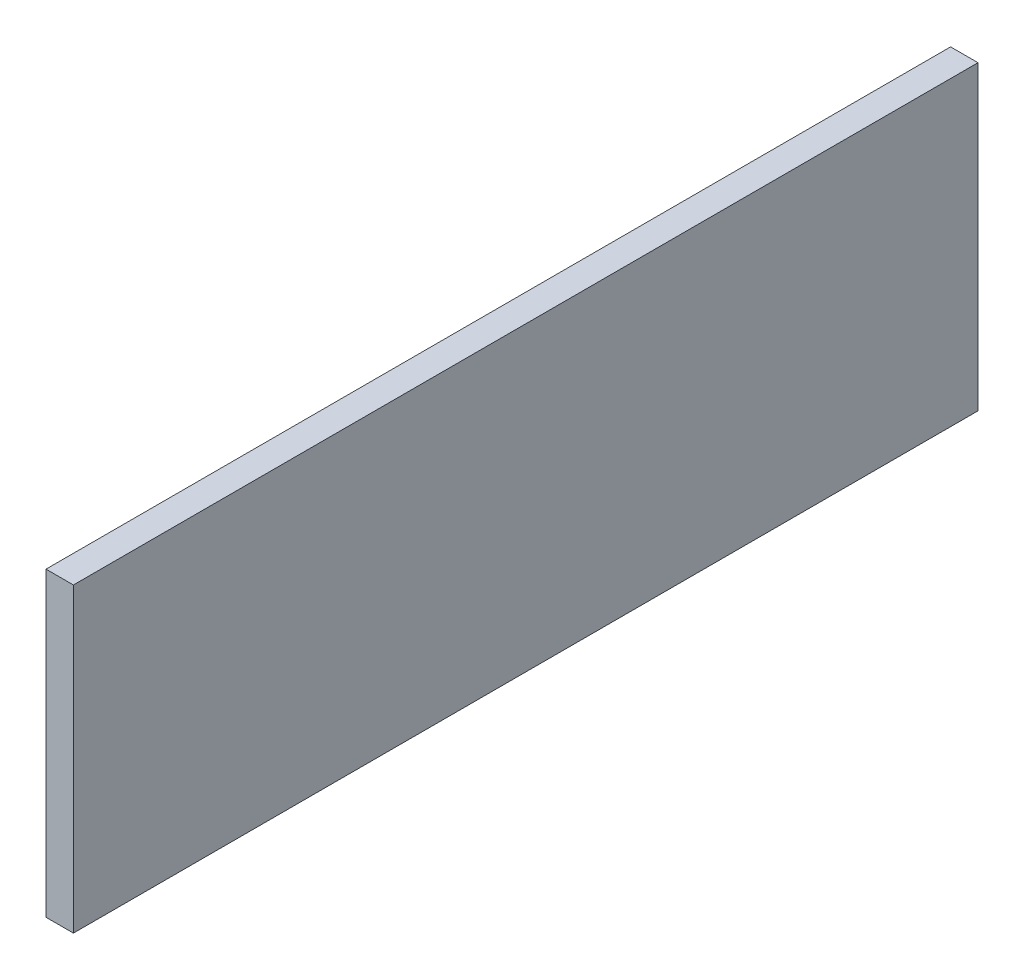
ISO-10303-21;
HEADER;
FILE_DESCRIPTION(('STEP AP214'),'2;1');
FILE_NAME('part.step','',(''),(''),'','','');
FILE_SCHEMA(('AUTOMOTIVE_DESIGN { 1 0 10303 214 1 1 1 1 }'));
ENDSEC;
DATA;
#1=APPLICATION_CONTEXT('core data for automotive mechanical design processes');
#2=APPLICATION_PROTOCOL_DEFINITION('international standard','automotive_design',2000,#1);
#3=PRODUCT_CONTEXT('',#1,'mechanical');
#4=PRODUCT('Part','Part','',(#3));
#5=PRODUCT_RELATED_PRODUCT_CATEGORY('part','',(#4));
#6=PRODUCT_DEFINITION_FORMATION('','',#4);
#7=PRODUCT_DEFINITION_CONTEXT('part definition',#1,'design');
#8=PRODUCT_DEFINITION('design','',#6,#7);
#9=PRODUCT_DEFINITION_SHAPE('','',#8);
#10=(LENGTH_UNIT() NAMED_UNIT(*) SI_UNIT(.MILLI.,.METRE.));
#11=(NAMED_UNIT(*) PLANE_ANGLE_UNIT() SI_UNIT($,.RADIAN.));
#12=(NAMED_UNIT(*) SI_UNIT($,.STERADIAN.) SOLID_ANGLE_UNIT());
#13=UNCERTAINTY_MEASURE_WITH_UNIT(LENGTH_MEASURE(1.E-05),#10,'distance_accuracy_value','');
#14=(GEOMETRIC_REPRESENTATION_CONTEXT(3) GLOBAL_UNCERTAINTY_ASSIGNED_CONTEXT((#13)) GLOBAL_UNIT_ASSIGNED_CONTEXT((#10,
#11,#12)) REPRESENTATION_CONTEXT('',''));
#15=CARTESIAN_POINT('',(0.,0.,0.));
#16=DIRECTION('',(0.,0.,1.));
#17=DIRECTION('',(1.,0.,0.));
#18=AXIS2_PLACEMENT_3D('',#15,#16,#17);
#19=CARTESIAN_POINT('',(12.7,69.85,209.55));
#20=DIRECTION('',(0.,0.,-1.));
#21=DIRECTION('',(-1.,0.,0.));
#22=AXIS2_PLACEMENT_3D('',#19,#20,#21);
#23=PLANE('',#22);
#24=DIRECTION('',(0.,-1.,0.));
#25=VECTOR('',#24,1.);
#26=CARTESIAN_POINT('',(0.,69.85,209.55));
#27=LINE('',#26,#25);
#28=CARTESIAN_POINT('',(0.,69.85,209.55));
#29=VERTEX_POINT('',#28);
#30=CARTESIAN_POINT('',(0.,-69.85,209.55));
#31=VERTEX_POINT('',#30);
#32=EDGE_CURVE('E94',#29,#31,#27,.T.);
#33=ORIENTED_EDGE('',*,*,#32,.T.);
#34=DIRECTION('',(-1.,0.,0.));
#35=VECTOR('',#34,1.);
#36=CARTESIAN_POINT('',(12.7,-69.85,209.55));
#37=LINE('',#36,#35);
#38=CARTESIAN_POINT('',(12.7,-69.85,209.55));
#39=VERTEX_POINT('',#38);
#40=EDGE_CURVE('E11',#39,#31,#37,.T.);
#41=ORIENTED_EDGE('',*,*,#40,.F.);
#42=DIRECTION('',(0.,-1.,0.));
#43=VECTOR('',#42,1.);
#44=CARTESIAN_POINT('',(12.7,69.85,209.55));
#45=LINE('',#44,#43);
#46=CARTESIAN_POINT('',(12.7,69.85,209.55));
#47=VERTEX_POINT('',#46);
#48=EDGE_CURVE('E82',#47,#39,#45,.T.);
#49=ORIENTED_EDGE('',*,*,#48,.F.);
#50=DIRECTION('',(-1.,0.,0.));
#51=VECTOR('',#50,1.);
#52=CARTESIAN_POINT('',(12.7,69.85,209.55));
#53=LINE('',#52,#51);
#54=EDGE_CURVE('E90',#47,#29,#53,.T.);
#55=ORIENTED_EDGE('',*,*,#54,.T.);
#56=EDGE_LOOP('',(#33,#41,#49,#55));
#57=FACE_BOUND('',#56,.T.);
#58=ADVANCED_FACE('F31',(#57),#23,.F.);
#59=CARTESIAN_POINT('',(12.7,-69.85,209.55));
#60=DIRECTION('',(0.,1.,0.));
#61=DIRECTION('',(0.,0.,1.));
#62=AXIS2_PLACEMENT_3D('',#59,#60,#61);
#63=PLANE('',#62);
#64=DIRECTION('',(0.,0.,-1.));
#65=VECTOR('',#64,1.);
#66=CARTESIAN_POINT('',(0.,-69.85,209.55));
#67=LINE('',#66,#65);
#68=CARTESIAN_POINT('',(0.,-69.85,-209.55));
#69=VERTEX_POINT('',#68);
#70=EDGE_CURVE('E86',#31,#69,#67,.T.);
#71=ORIENTED_EDGE('',*,*,#70,.T.);
#72=DIRECTION('',(-1.,0.,0.));
#73=VECTOR('',#72,1.);
#74=CARTESIAN_POINT('',(12.7,-69.85,-209.55));
#75=LINE('',#74,#73);
#76=CARTESIAN_POINT('',(12.7,-69.85,-209.55));
#77=VERTEX_POINT('',#76);
#78=EDGE_CURVE('E39',#77,#69,#75,.T.);
#79=ORIENTED_EDGE('',*,*,#78,.F.);
#80=DIRECTION('',(0.,0.,-1.));
#81=VECTOR('',#80,1.);
#82=CARTESIAN_POINT('',(12.7,-69.85,209.55));
#83=LINE('',#82,#81);
#84=EDGE_CURVE('E77',#39,#77,#83,.T.);
#85=ORIENTED_EDGE('',*,*,#84,.F.);
#86=ORIENTED_EDGE('',*,*,#40,.T.);
#87=EDGE_LOOP('',(#71,#79,#85,#86));
#88=FACE_BOUND('',#87,.T.);
#89=ADVANCED_FACE('F85',(#88),#63,.F.);
#90=CARTESIAN_POINT('',(12.7,69.85,-209.55));
#91=DIRECTION('',(0.,0.,1.));
#92=DIRECTION('',(0.,-1.,0.));
#93=AXIS2_PLACEMENT_3D('',#90,#91,#92);
#94=PLANE('',#93);
#95=DIRECTION('',(0.,1.,0.));
#96=VECTOR('',#95,1.);
#97=CARTESIAN_POINT('',(0.,69.85,-209.55));
#98=LINE('',#97,#96);
#99=CARTESIAN_POINT('',(0.,69.85,-209.55));
#100=VERTEX_POINT('',#99);
#101=EDGE_CURVE('E64',#69,#100,#98,.T.);
#102=ORIENTED_EDGE('',*,*,#101,.T.);
#103=DIRECTION('',(-1.,0.,0.));
#104=VECTOR('',#103,1.);
#105=CARTESIAN_POINT('',(12.7,69.85,-209.55));
#106=LINE('',#105,#104);
#107=CARTESIAN_POINT('',(12.7,69.85,-209.55));
#108=VERTEX_POINT('',#107);
#109=EDGE_CURVE('E87',#108,#100,#106,.T.);
#110=ORIENTED_EDGE('',*,*,#109,.F.);
#111=DIRECTION('',(0.,1.,0.));
#112=VECTOR('',#111,1.);
#113=CARTESIAN_POINT('',(12.7,69.85,-209.55));
#114=LINE('',#113,#112);
#115=EDGE_CURVE('E80',#77,#108,#114,.T.);
#116=ORIENTED_EDGE('',*,*,#115,.F.);
#117=ORIENTED_EDGE('',*,*,#78,.T.);
#118=EDGE_LOOP('',(#102,#110,#116,#117));
#119=FACE_BOUND('',#118,.T.);
#120=ADVANCED_FACE('F88',(#119),#94,.F.);
#121=CARTESIAN_POINT('',(12.7,69.85,209.55));
#122=DIRECTION('',(0.,-1.,0.));
#123=DIRECTION('',(0.,0.,-1.));
#124=AXIS2_PLACEMENT_3D('',#121,#122,#123);
#125=PLANE('',#124);
#126=DIRECTION('',(0.,0.,1.));
#127=VECTOR('',#126,1.);
#128=CARTESIAN_POINT('',(0.,69.85,209.55));
#129=LINE('',#128,#127);
#130=EDGE_CURVE('E70',#100,#29,#129,.T.);
#131=ORIENTED_EDGE('',*,*,#130,.T.);
#132=ORIENTED_EDGE('',*,*,#54,.F.);
#133=DIRECTION('',(0.,0.,1.));
#134=VECTOR('',#133,1.);
#135=CARTESIAN_POINT('',(12.7,69.85,209.55));
#136=LINE('',#135,#134);
#137=EDGE_CURVE('E47',#108,#47,#136,.T.);
#138=ORIENTED_EDGE('',*,*,#137,.F.);
#139=ORIENTED_EDGE('',*,*,#109,.T.);
#140=EDGE_LOOP('',(#131,#132,#138,#139));
#141=FACE_BOUND('',#140,.T.);
#142=ADVANCED_FACE('F101',(#141),#125,.F.);
#143=CARTESIAN_POINT('',(12.7,-69.85,209.55));
#144=DIRECTION('',(1.,0.,0.));
#145=DIRECTION('',(0.,0.,-1.));
#146=AXIS2_PLACEMENT_3D('',#143,#144,#145);
#147=PLANE('',#146);
#148=ORIENTED_EDGE('',*,*,#48,.T.);
#149=ORIENTED_EDGE('',*,*,#84,.T.);
#150=ORIENTED_EDGE('',*,*,#115,.T.);
#151=ORIENTED_EDGE('',*,*,#137,.T.);
#152=EDGE_LOOP('',(#148,#149,#150,#151));
#153=FACE_BOUND('',#152,.T.);
#154=ADVANCED_FACE('F78',(#153),#147,.T.);
#155=CARTESIAN_POINT('',(0.,-69.85,209.55));
#156=DIRECTION('',(1.,0.,0.));
#157=DIRECTION('',(0.,0.,-1.));
#158=AXIS2_PLACEMENT_3D('',#155,#156,#157);
#159=PLANE('',#158);
#160=ORIENTED_EDGE('',*,*,#32,.F.);
#161=ORIENTED_EDGE('',*,*,#130,.F.);
#162=ORIENTED_EDGE('',*,*,#101,.F.);
#163=ORIENTED_EDGE('',*,*,#70,.F.);
#164=EDGE_LOOP('',(#160,#161,#162,#163));
#165=FACE_BOUND('',#164,.T.);
#166=ADVANCED_FACE('F104',(#165),#159,.F.);
#167=CLOSED_SHELL('',(#58,#89,#120,#142,#154,#166));
#168=MANIFOLD_SOLID_BREP('B2',#167);
#169=ADVANCED_BREP_SHAPE_REPRESENTATION('',(#18,#168),#14);
#170=SHAPE_DEFINITION_REPRESENTATION(#9,#169);
ENDSEC;
END-ISO-10303-21;
